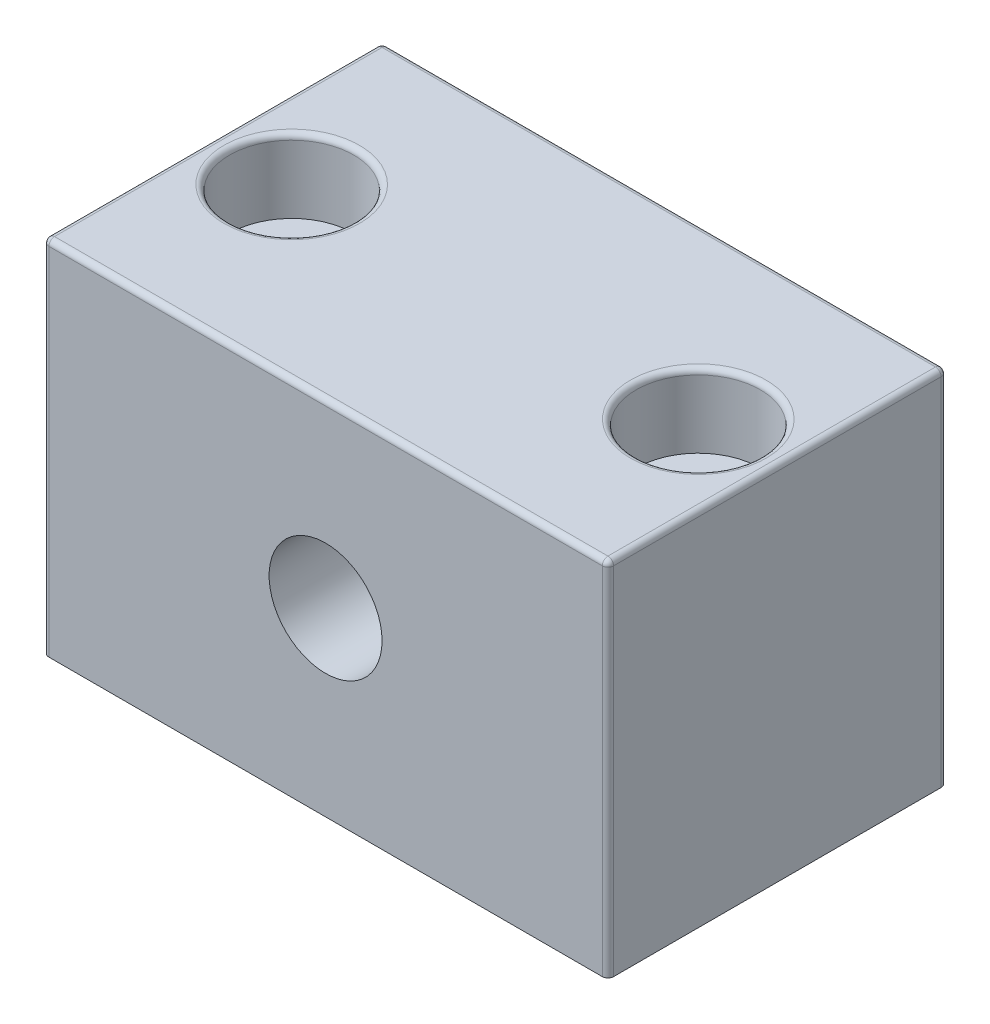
ISO-10303-21;
HEADER;
FILE_DESCRIPTION(('STEP AP214'),'2;1');
FILE_NAME('part.step','',(''),(''),'','','');
FILE_SCHEMA(('AUTOMOTIVE_DESIGN { 1 0 10303 214 1 1 1 1 }'));
ENDSEC;
DATA;
#1=APPLICATION_CONTEXT('core data for automotive mechanical design processes');
#2=APPLICATION_PROTOCOL_DEFINITION('international standard','automotive_design',2000,#1);
#3=PRODUCT_CONTEXT('',#1,'mechanical');
#4=PRODUCT('Part','Part','',(#3));
#5=PRODUCT_RELATED_PRODUCT_CATEGORY('part','',(#4));
#6=PRODUCT_DEFINITION_FORMATION('','',#4);
#7=PRODUCT_DEFINITION_CONTEXT('part definition',#1,'design');
#8=PRODUCT_DEFINITION('design','',#6,#7);
#9=PRODUCT_DEFINITION_SHAPE('','',#8);
#10=(LENGTH_UNIT() NAMED_UNIT(*) SI_UNIT(.MILLI.,.METRE.));
#11=(NAMED_UNIT(*) PLANE_ANGLE_UNIT() SI_UNIT($,.RADIAN.));
#12=(NAMED_UNIT(*) SI_UNIT($,.STERADIAN.) SOLID_ANGLE_UNIT());
#13=UNCERTAINTY_MEASURE_WITH_UNIT(LENGTH_MEASURE(1.E-05),#10,'distance_accuracy_value','');
#14=(GEOMETRIC_REPRESENTATION_CONTEXT(3) GLOBAL_UNCERTAINTY_ASSIGNED_CONTEXT((#13)) GLOBAL_UNIT_ASSIGNED_CONTEXT((#10,
#11,#12)) REPRESENTATION_CONTEXT('',''));
#15=CARTESIAN_POINT('',(0.,0.,0.));
#16=DIRECTION('',(0.,0.,1.));
#17=DIRECTION('',(1.,0.,0.));
#18=AXIS2_PLACEMENT_3D('',#15,#16,#17);
#19=CARTESIAN_POINT('',(0.,0.,-15.));
#20=DIRECTION('',(0.,-1.,0.));
#21=DIRECTION('',(0.,0.,-1.));
#22=AXIS2_PLACEMENT_3D('',#19,#20,#21);
#23=PLANE('',#22);
#24=DIRECTION('',(0.,0.,1.));
#25=VECTOR('',#24,1.);
#26=CARTESIAN_POINT('',(0.,0.,-15.));
#27=LINE('',#26,#25);
#28=CARTESIAN_POINT('',(0.,0.,-14.5));
#29=VERTEX_POINT('',#28);
#30=CARTESIAN_POINT('',(0.,0.,14.5));
#31=VERTEX_POINT('',#30);
#32=EDGE_CURVE('E244',#29,#31,#27,.T.);
#33=ORIENTED_EDGE('',*,*,#32,.F.);
#34=CARTESIAN_POINT('',(0.5,0.,-14.5));
#35=DIRECTION('',(0.,-1.,0.));
#36=DIRECTION('',(0.,0.,-1.));
#37=AXIS2_PLACEMENT_3D('',#34,#35,#36);
#38=CIRCLE('',#37,0.5);
#39=CARTESIAN_POINT('',(0.5,0.,-15.));
#40=VERTEX_POINT('',#39);
#41=EDGE_CURVE('E11',#29,#40,#38,.T.);
#42=ORIENTED_EDGE('',*,*,#41,.T.);
#43=DIRECTION('',(1.,0.,0.));
#44=VECTOR('',#43,1.);
#45=CARTESIAN_POINT('',(0.,0.,-15.));
#46=LINE('',#45,#44);
#47=CARTESIAN_POINT('',(49.5,0.,-15.));
#48=VERTEX_POINT('',#47);
#49=EDGE_CURVE('E241',#40,#48,#46,.T.);
#50=ORIENTED_EDGE('',*,*,#49,.T.);
#51=CARTESIAN_POINT('',(49.5,0.,-14.5));
#52=DIRECTION('',(0.,-1.,0.));
#53=DIRECTION('',(0.,0.,-1.));
#54=AXIS2_PLACEMENT_3D('',#51,#52,#53);
#55=CIRCLE('',#54,0.5);
#56=CARTESIAN_POINT('',(50.,0.,-14.5));
#57=VERTEX_POINT('',#56);
#58=EDGE_CURVE('E42',#48,#57,#55,.T.);
#59=ORIENTED_EDGE('',*,*,#58,.T.);
#60=DIRECTION('',(0.,0.,1.));
#61=VECTOR('',#60,1.);
#62=CARTESIAN_POINT('',(50.,0.,-15.));
#63=LINE('',#62,#61);
#64=CARTESIAN_POINT('',(50.,0.,14.5));
#65=VERTEX_POINT('',#64);
#66=EDGE_CURVE('E140',#57,#65,#63,.T.);
#67=ORIENTED_EDGE('',*,*,#66,.T.);
#68=CARTESIAN_POINT('',(49.5,0.,14.5));
#69=DIRECTION('',(0.,-1.,0.));
#70=DIRECTION('',(0.,0.,-1.));
#71=AXIS2_PLACEMENT_3D('',#68,#69,#70);
#72=CIRCLE('',#71,0.5);
#73=CARTESIAN_POINT('',(49.5,0.,15.));
#74=VERTEX_POINT('',#73);
#75=EDGE_CURVE('E185',#65,#74,#72,.T.);
#76=ORIENTED_EDGE('',*,*,#75,.T.);
#77=DIRECTION('',(1.,0.,0.));
#78=VECTOR('',#77,1.);
#79=CARTESIAN_POINT('',(0.,0.,15.));
#80=LINE('',#79,#78);
#81=CARTESIAN_POINT('',(0.5,0.,15.));
#82=VERTEX_POINT('',#81);
#83=EDGE_CURVE('E236',#82,#74,#80,.T.);
#84=ORIENTED_EDGE('',*,*,#83,.F.);
#85=CARTESIAN_POINT('',(0.5,0.,14.5));
#86=DIRECTION('',(0.,-1.,0.));
#87=DIRECTION('',(0.,0.,-1.));
#88=AXIS2_PLACEMENT_3D('',#85,#86,#87);
#89=CIRCLE('',#88,0.5);
#90=EDGE_CURVE('E183',#82,#31,#89,.T.);
#91=ORIENTED_EDGE('',*,*,#90,.T.);
#92=EDGE_LOOP('',(#33,#42,#50,#59,#67,#76,#84,#91));
#93=FACE_BOUND('',#92,.T.);
#94=CARTESIAN_POINT('',(43.,0.,0.));
#95=DIRECTION('',(0.,1.,0.));
#96=DIRECTION('',(0.,0.,1.));
#97=AXIS2_PLACEMENT_3D('',#94,#95,#96);
#98=CIRCLE('',#97,3.3);
#99=CARTESIAN_POINT('',(43.,0.,3.3));
#100=VERTEX_POINT('',#99);
#101=EDGE_CURVE('E224',#100,#100,#98,.T.);
#102=ORIENTED_EDGE('',*,*,#101,.T.);
#103=EDGE_LOOP('',(#102));
#104=FACE_BOUND('',#103,.T.);
#105=CARTESIAN_POINT('',(7.000000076,0.,0.));
#106=DIRECTION('',(0.,-1.,0.));
#107=DIRECTION('',(0.,0.,1.));
#108=AXIS2_PLACEMENT_3D('',#105,#106,#107);
#109=CIRCLE('',#108,3.3);
#110=CARTESIAN_POINT('',(7.000000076,0.,3.3));
#111=VERTEX_POINT('',#110);
#112=EDGE_CURVE('E213',#111,#111,#109,.T.);
#113=ORIENTED_EDGE('',*,*,#112,.F.);
#114=EDGE_LOOP('',(#113));
#115=FACE_BOUND('',#114,.T.);
#116=ADVANCED_FACE('F33',(#93,#104,#115),#23,.T.);
#117=CARTESIAN_POINT('',(7.000000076,25.5,0.));
#118=DIRECTION('',(0.,1.,0.));
#119=DIRECTION('',(0.,0.,1.));
#120=AXIS2_PLACEMENT_3D('',#117,#118,#119);
#121=PLANE('',#120);
#122=CARTESIAN_POINT('',(7.000000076,25.5,0.));
#123=DIRECTION('',(0.,-1.,0.));
#124=DIRECTION('',(0.,0.,1.));
#125=AXIS2_PLACEMENT_3D('',#122,#123,#124);
#126=CIRCLE('',#125,5.5);
#127=CARTESIAN_POINT('',(7.000000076,25.5,5.5));
#128=VERTEX_POINT('',#127);
#129=EDGE_CURVE('E218',#128,#128,#126,.T.);
#130=ORIENTED_EDGE('',*,*,#129,.F.);
#131=EDGE_LOOP('',(#130));
#132=FACE_BOUND('',#131,.T.);
#133=CARTESIAN_POINT('',(7.000000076,25.5,0.));
#134=DIRECTION('',(0.,-1.,0.));
#135=DIRECTION('',(0.,0.,1.));
#136=AXIS2_PLACEMENT_3D('',#133,#134,#135);
#137=CIRCLE('',#136,3.3);
#138=CARTESIAN_POINT('',(7.000000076,25.5,3.3));
#139=VERTEX_POINT('',#138);
#140=EDGE_CURVE('E210',#139,#139,#137,.T.);
#141=ORIENTED_EDGE('',*,*,#140,.T.);
#142=EDGE_LOOP('',(#141));
#143=FACE_BOUND('',#142,.T.);
#144=ADVANCED_FACE('F291',(#132,#143),#121,.T.);
#145=CARTESIAN_POINT('',(0.,32.,-15.));
#146=DIRECTION('',(0.,1.,0.));
#147=DIRECTION('',(0.,0.,1.));
#148=AXIS2_PLACEMENT_3D('',#145,#146,#147);
#149=PLANE('',#148);
#150=CARTESIAN_POINT('',(7.000000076,32.,0.));
#151=DIRECTION('',(0.,1.,0.));
#152=DIRECTION('',(0.,0.,1.));
#153=AXIS2_PLACEMENT_3D('',#150,#151,#152);
#154=CIRCLE('',#153,6.);
#155=CARTESIAN_POINT('',(7.000000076,32.,6.));
#156=VERTEX_POINT('',#155);
#157=EDGE_CURVE('E149',#156,#156,#154,.F.);
#158=ORIENTED_EDGE('',*,*,#157,.T.);
#159=EDGE_LOOP('',(#158));
#160=FACE_BOUND('',#159,.T.);
#161=CARTESIAN_POINT('',(43.,32.,0.));
#162=DIRECTION('',(0.,1.,0.));
#163=DIRECTION('',(0.,0.,1.));
#164=AXIS2_PLACEMENT_3D('',#161,#162,#163);
#165=CIRCLE('',#164,6.);
#166=CARTESIAN_POINT('',(43.,32.,6.));
#167=VERTEX_POINT('',#166);
#168=EDGE_CURVE('E146',#167,#167,#165,.F.);
#169=ORIENTED_EDGE('',*,*,#168,.T.);
#170=EDGE_LOOP('',(#169));
#171=FACE_BOUND('',#170,.T.);
#172=DIRECTION('',(0.,0.,1.));
#173=VECTOR('',#172,1.);
#174=CARTESIAN_POINT('',(49.5,32.,-15.));
#175=LINE('',#174,#173);
#176=CARTESIAN_POINT('',(49.5,32.,14.5));
#177=VERTEX_POINT('',#176);
#178=CARTESIAN_POINT('',(49.5,32.,-14.5));
#179=VERTEX_POINT('',#178);
#180=EDGE_CURVE('E144',#177,#179,#175,.F.);
#181=ORIENTED_EDGE('',*,*,#180,.T.);
#182=DIRECTION('',(-1.,0.,0.));
#183=VECTOR('',#182,1.);
#184=CARTESIAN_POINT('',(0.,32.,-14.5));
#185=LINE('',#184,#183);
#186=CARTESIAN_POINT('',(0.5,32.,-14.5));
#187=VERTEX_POINT('',#186);
#188=EDGE_CURVE('E116',#179,#187,#185,.T.);
#189=ORIENTED_EDGE('',*,*,#188,.T.);
#190=DIRECTION('',(0.,0.,1.));
#191=VECTOR('',#190,1.);
#192=CARTESIAN_POINT('',(0.5,32.,-15.));
#193=LINE('',#192,#191);
#194=CARTESIAN_POINT('',(0.5,32.,14.5));
#195=VERTEX_POINT('',#194);
#196=EDGE_CURVE('E133',#187,#195,#193,.T.);
#197=ORIENTED_EDGE('',*,*,#196,.T.);
#198=DIRECTION('',(-1.,0.,0.));
#199=VECTOR('',#198,1.);
#200=CARTESIAN_POINT('',(50.,32.,14.5));
#201=LINE('',#200,#199);
#202=EDGE_CURVE('E139',#195,#177,#201,.F.);
#203=ORIENTED_EDGE('',*,*,#202,.T.);
#204=EDGE_LOOP('',(#181,#189,#197,#203));
#205=FACE_BOUND('',#204,.T.);
#206=ADVANCED_FACE('F142',(#160,#171,#205),#149,.T.);
#207=CARTESIAN_POINT('',(0.,0.,-15.));
#208=DIRECTION('',(-1.,0.,0.));
#209=DIRECTION('',(0.,0.,1.));
#210=AXIS2_PLACEMENT_3D('',#207,#208,#209);
#211=PLANE('',#210);
#212=DIRECTION('',(0.,0.,1.));
#213=VECTOR('',#212,1.);
#214=CARTESIAN_POINT('',(0.,31.5,-15.));
#215=LINE('',#214,#213);
#216=CARTESIAN_POINT('',(0.,31.5,14.5));
#217=VERTEX_POINT('',#216);
#218=CARTESIAN_POINT('',(0.,31.5,-14.5));
#219=VERTEX_POINT('',#218);
#220=EDGE_CURVE('E50',#217,#219,#215,.F.);
#221=ORIENTED_EDGE('',*,*,#220,.T.);
#222=DIRECTION('',(0.,-1.,0.));
#223=VECTOR('',#222,1.);
#224=CARTESIAN_POINT('',(0.,0.,-14.5));
#225=LINE('',#224,#223);
#226=EDGE_CURVE('E181',#219,#29,#225,.T.);
#227=ORIENTED_EDGE('',*,*,#226,.T.);
#228=ORIENTED_EDGE('',*,*,#32,.T.);
#229=DIRECTION('',(0.,-1.,0.));
#230=VECTOR('',#229,1.);
#231=CARTESIAN_POINT('',(0.,32.,14.5));
#232=LINE('',#231,#230);
#233=EDGE_CURVE('E55',#31,#217,#232,.F.);
#234=ORIENTED_EDGE('',*,*,#233,.T.);
#235=EDGE_LOOP('',(#221,#227,#228,#234));
#236=FACE_BOUND('',#235,.T.);
#237=ADVANCED_FACE('F272',(#236),#211,.T.);
#238=CARTESIAN_POINT('',(50.,0.,-15.));
#239=DIRECTION('',(1.,0.,0.));
#240=DIRECTION('',(0.,0.,-1.));
#241=AXIS2_PLACEMENT_3D('',#238,#239,#240);
#242=PLANE('',#241);
#243=ORIENTED_EDGE('',*,*,#66,.F.);
#244=DIRECTION('',(0.,1.,0.));
#245=VECTOR('',#244,1.);
#246=CARTESIAN_POINT('',(50.,0.,-14.5));
#247=LINE('',#246,#245);
#248=CARTESIAN_POINT('',(50.,31.5,-14.5));
#249=VERTEX_POINT('',#248);
#250=EDGE_CURVE('E171',#57,#249,#247,.T.);
#251=ORIENTED_EDGE('',*,*,#250,.T.);
#252=DIRECTION('',(0.,0.,1.));
#253=VECTOR('',#252,1.);
#254=CARTESIAN_POINT('',(50.,31.5,-15.));
#255=LINE('',#254,#253);
#256=CARTESIAN_POINT('',(50.,31.5,14.5));
#257=VERTEX_POINT('',#256);
#258=EDGE_CURVE('E169',#249,#257,#255,.T.);
#259=ORIENTED_EDGE('',*,*,#258,.T.);
#260=DIRECTION('',(0.,1.,0.));
#261=VECTOR('',#260,1.);
#262=CARTESIAN_POINT('',(50.,0.,14.5));
#263=LINE('',#262,#261);
#264=EDGE_CURVE('E167',#257,#65,#263,.F.);
#265=ORIENTED_EDGE('',*,*,#264,.T.);
#266=EDGE_LOOP('',(#243,#251,#259,#265));
#267=FACE_BOUND('',#266,.T.);
#268=ADVANCED_FACE('F300',(#267),#242,.T.);
#269=CARTESIAN_POINT('',(0.,0.,-15.));
#270=DIRECTION('',(0.,0.,-1.));
#271=DIRECTION('',(-1.,0.,0.));
#272=AXIS2_PLACEMENT_3D('',#269,#270,#271);
#273=PLANE('',#272);
#274=CARTESIAN_POINT('',(25.,16.,-15.));
#275=DIRECTION('',(0.,0.,1.));
#276=DIRECTION('',(1.,0.,0.));
#277=AXIS2_PLACEMENT_3D('',#274,#275,#276);
#278=CIRCLE('',#277,5.);
#279=CARTESIAN_POINT('',(30.,16.,-15.));
#280=VERTEX_POINT('',#279);
#281=EDGE_CURVE('E233',#280,#280,#278,.T.);
#282=ORIENTED_EDGE('',*,*,#281,.T.);
#283=EDGE_LOOP('',(#282));
#284=FACE_BOUND('',#283,.T.);
#285=ORIENTED_EDGE('',*,*,#49,.F.);
#286=DIRECTION('',(0.,-1.,0.));
#287=VECTOR('',#286,1.);
#288=CARTESIAN_POINT('',(0.5,0.,-15.));
#289=LINE('',#288,#287);
#290=CARTESIAN_POINT('',(0.5,31.5,-15.));
#291=VERTEX_POINT('',#290);
#292=EDGE_CURVE('E165',#40,#291,#289,.F.);
#293=ORIENTED_EDGE('',*,*,#292,.T.);
#294=DIRECTION('',(-1.,0.,0.));
#295=VECTOR('',#294,1.);
#296=CARTESIAN_POINT('',(0.,31.5,-15.));
#297=LINE('',#296,#295);
#298=CARTESIAN_POINT('',(49.5,31.5,-15.));
#299=VERTEX_POINT('',#298);
#300=EDGE_CURVE('E118',#291,#299,#297,.F.);
#301=ORIENTED_EDGE('',*,*,#300,.T.);
#302=DIRECTION('',(0.,1.,0.));
#303=VECTOR('',#302,1.);
#304=CARTESIAN_POINT('',(49.5,0.,-15.));
#305=LINE('',#304,#303);
#306=EDGE_CURVE('E162',#299,#48,#305,.F.);
#307=ORIENTED_EDGE('',*,*,#306,.T.);
#308=EDGE_LOOP('',(#285,#293,#301,#307));
#309=FACE_BOUND('',#308,.T.);
#310=ADVANCED_FACE('F266',(#284,#309),#273,.T.);
#311=CARTESIAN_POINT('',(0.,0.,15.));
#312=DIRECTION('',(0.,0.,-1.));
#313=DIRECTION('',(-1.,0.,0.));
#314=AXIS2_PLACEMENT_3D('',#311,#312,#313);
#315=PLANE('',#314);
#316=CARTESIAN_POINT('',(25.,16.,15.));
#317=DIRECTION('',(0.,0.,1.));
#318=DIRECTION('',(1.,0.,0.));
#319=AXIS2_PLACEMENT_3D('',#316,#317,#318);
#320=CIRCLE('',#319,5.);
#321=CARTESIAN_POINT('',(30.,16.,15.));
#322=VERTEX_POINT('',#321);
#323=EDGE_CURVE('E232',#322,#322,#320,.T.);
#324=ORIENTED_EDGE('',*,*,#323,.F.);
#325=EDGE_LOOP('',(#324));
#326=FACE_BOUND('',#325,.T.);
#327=ORIENTED_EDGE('',*,*,#83,.T.);
#328=DIRECTION('',(0.,1.,0.));
#329=VECTOR('',#328,1.);
#330=CARTESIAN_POINT('',(49.5,32.,15.));
#331=LINE('',#330,#329);
#332=CARTESIAN_POINT('',(49.5,31.5,15.));
#333=VERTEX_POINT('',#332);
#334=EDGE_CURVE('E177',#74,#333,#331,.T.);
#335=ORIENTED_EDGE('',*,*,#334,.T.);
#336=DIRECTION('',(-1.,0.,0.));
#337=VECTOR('',#336,1.);
#338=CARTESIAN_POINT('',(0.,31.5,15.));
#339=LINE('',#338,#337);
#340=CARTESIAN_POINT('',(0.5,31.5,15.));
#341=VERTEX_POINT('',#340);
#342=EDGE_CURVE('E175',#333,#341,#339,.T.);
#343=ORIENTED_EDGE('',*,*,#342,.T.);
#344=DIRECTION('',(0.,-1.,0.));
#345=VECTOR('',#344,1.);
#346=CARTESIAN_POINT('',(0.5,0.,15.));
#347=LINE('',#346,#345);
#348=EDGE_CURVE('E173',#341,#82,#347,.T.);
#349=ORIENTED_EDGE('',*,*,#348,.T.);
#350=EDGE_LOOP('',(#327,#335,#343,#349));
#351=FACE_BOUND('',#350,.T.);
#352=ADVANCED_FACE('F474',(#326,#351),#315,.F.);
#353=CARTESIAN_POINT('',(25.,16.,-15.));
#354=DIRECTION('',(0.,0.,1.));
#355=DIRECTION('',(1.,0.,0.));
#356=AXIS2_PLACEMENT_3D('',#353,#354,#355);
#357=CYLINDRICAL_SURFACE('',#356,5.);
#358=ORIENTED_EDGE('',*,*,#281,.F.);
#359=EDGE_LOOP('',(#358));
#360=FACE_BOUND('',#359,.T.);
#361=ORIENTED_EDGE('',*,*,#323,.T.);
#362=EDGE_LOOP('',(#361));
#363=FACE_BOUND('',#362,.T.);
#364=ADVANCED_FACE('F465',(#360,#363),#357,.F.);
#365=CARTESIAN_POINT('',(43.,25.5,0.));
#366=DIRECTION('',(0.,1.,0.));
#367=DIRECTION('',(0.,0.,1.));
#368=AXIS2_PLACEMENT_3D('',#365,#366,#367);
#369=CYLINDRICAL_SURFACE('',#368,5.5);
#370=CARTESIAN_POINT('',(43.,31.5,0.));
#371=DIRECTION('',(0.,1.,0.));
#372=DIRECTION('',(0.,0.,1.));
#373=AXIS2_PLACEMENT_3D('',#370,#371,#372);
#374=CIRCLE('',#373,5.5);
#375=CARTESIAN_POINT('',(43.,31.5,5.5));
#376=VERTEX_POINT('',#375);
#377=EDGE_CURVE('E159',#376,#376,#374,.T.);
#378=CARTESIAN_POINT('',(43.,25.5,0.));
#379=DIRECTION('',(0.,1.,0.));
#380=DIRECTION('',(0.,0.,1.));
#381=AXIS2_PLACEMENT_3D('',#378,#379,#380);
#382=CIRCLE('',#381,5.5);
#383=CARTESIAN_POINT('',(43.,25.5,5.5));
#384=VERTEX_POINT('',#383);
#385=EDGE_CURVE('E227',#384,#384,#382,.T.);
#386=CARTESIAN_POINT('',(43.,31.5,5.5));
#387=CARTESIAN_POINT('',(43.,31.4375,5.5));
#388=CARTESIAN_POINT('',(43.,31.375,5.5));
#389=CARTESIAN_POINT('',(43.,31.25,5.5));
#390=CARTESIAN_POINT('',(43.,31.1875,5.5));
#391=CARTESIAN_POINT('',(43.,31.0625,5.5));
#392=CARTESIAN_POINT('',(43.,31.,5.5));
#393=CARTESIAN_POINT('',(43.,30.875,5.5));
#394=CARTESIAN_POINT('',(43.,30.8125,5.5));
#395=CARTESIAN_POINT('',(43.,30.6875,5.5));
#396=CARTESIAN_POINT('',(43.,30.625,5.5));
#397=CARTESIAN_POINT('',(43.,30.5,5.5));
#398=CARTESIAN_POINT('',(43.,30.4375,5.5));
#399=CARTESIAN_POINT('',(43.,30.3125,5.5));
#400=CARTESIAN_POINT('',(43.,30.25,5.5));
#401=CARTESIAN_POINT('',(43.,30.125,5.5));
#402=CARTESIAN_POINT('',(43.,30.0625,5.5));
#403=CARTESIAN_POINT('',(43.,29.9375,5.5));
#404=CARTESIAN_POINT('',(43.,29.875,5.5));
#405=CARTESIAN_POINT('',(43.,29.75,5.5));
#406=CARTESIAN_POINT('',(43.,29.6875,5.5));
#407=CARTESIAN_POINT('',(43.,29.5625,5.5));
#408=CARTESIAN_POINT('',(43.,29.5,5.5));
#409=CARTESIAN_POINT('',(43.,29.375,5.5));
#410=CARTESIAN_POINT('',(43.,29.3125,5.5));
#411=CARTESIAN_POINT('',(43.,29.1875,5.5));
#412=CARTESIAN_POINT('',(43.,29.125,5.5));
#413=CARTESIAN_POINT('',(43.,29.,5.5));
#414=CARTESIAN_POINT('',(43.,28.9375,5.5));
#415=CARTESIAN_POINT('',(43.,28.8125,5.5));
#416=CARTESIAN_POINT('',(43.,28.75,5.5));
#417=CARTESIAN_POINT('',(43.,28.625,5.5));
#418=CARTESIAN_POINT('',(43.,28.5625,5.5));
#419=CARTESIAN_POINT('',(43.,28.4375,5.5));
#420=CARTESIAN_POINT('',(43.,28.375,5.5));
#421=CARTESIAN_POINT('',(43.,28.25,5.5));
#422=CARTESIAN_POINT('',(43.,28.1875,5.5));
#423=CARTESIAN_POINT('',(43.,28.0625,5.5));
#424=CARTESIAN_POINT('',(43.,28.,5.5));
#425=CARTESIAN_POINT('',(43.,27.875,5.5));
#426=CARTESIAN_POINT('',(43.,27.8125,5.5));
#427=CARTESIAN_POINT('',(43.,27.6875,5.5));
#428=CARTESIAN_POINT('',(43.,27.625,5.5));
#429=CARTESIAN_POINT('',(43.,27.5,5.5));
#430=CARTESIAN_POINT('',(43.,27.4375,5.5));
#431=CARTESIAN_POINT('',(43.,27.3125,5.5));
#432=CARTESIAN_POINT('',(43.,27.25,5.5));
#433=CARTESIAN_POINT('',(43.,27.125,5.5));
#434=CARTESIAN_POINT('',(43.,27.0625,5.5));
#435=CARTESIAN_POINT('',(43.,26.9375,5.5));
#436=CARTESIAN_POINT('',(43.,26.875,5.5));
#437=CARTESIAN_POINT('',(43.,26.75,5.5));
#438=CARTESIAN_POINT('',(43.,26.6875,5.5));
#439=CARTESIAN_POINT('',(43.,26.5625,5.5));
#440=CARTESIAN_POINT('',(43.,26.5,5.5));
#441=CARTESIAN_POINT('',(43.,26.375,5.5));
#442=CARTESIAN_POINT('',(43.,26.3125,5.5));
#443=CARTESIAN_POINT('',(43.,26.1875,5.5));
#444=CARTESIAN_POINT('',(43.,26.125,5.5));
#445=CARTESIAN_POINT('',(43.,26.,5.5));
#446=CARTESIAN_POINT('',(43.,25.9375,5.5));
#447=CARTESIAN_POINT('',(43.,25.8125,5.5));
#448=CARTESIAN_POINT('',(43.,25.75,5.5));
#449=CARTESIAN_POINT('',(43.,25.625,5.5));
#450=CARTESIAN_POINT('',(43.,25.5625,5.5));
#451=CARTESIAN_POINT('',(43.,25.5,5.5));
#452=B_SPLINE_CURVE_WITH_KNOTS('',3,(#386,#387,#388,#389,#390,#391,#392,#393,#394,#395,#396,
#397,#398,#399,#400,#401,#402,#403,#404,#405,#406,#407,#408,#409,#410,#411,#412,#413,#414,#415,
#416,#417,#418,#419,#420,#421,#422,#423,#424,#425,#426,#427,#428,#429,#430,#431,#432,#433,#434,
#435,#436,#437,#438,#439,#440,#441,#442,#443,#444,#445,#446,#447,#448,#449,#450,#451),
.UNSPECIFIED.,.F.,.F.,(4,2,2,2,2,2,2,2,2,2,2,2,2,2,2,2,2,2,2,2,2,2,2,2,2,2,2,2,2,2,2,2,4),(0.,
0.1875,0.374999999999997,0.562499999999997,0.749999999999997,0.937499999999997,1.125,1.3125,1.5,
1.68749999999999,1.87499999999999,2.06249999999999,2.25,2.4375,2.625,2.8125,3.,3.1875,3.375,
3.5625,3.75,3.93749999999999,4.12499999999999,4.31249999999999,4.49999999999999,
4.68749999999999,4.87499999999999,5.06249999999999,5.24999999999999,5.43749999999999,
5.62499999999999,5.81249999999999,5.99999999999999),.UNSPECIFIED.);
#453=EDGE_CURVE('BSEAM456',#376,#384,#452,.T.);
#454=ORIENTED_EDGE('',*,*,#377,.T.);
#455=ORIENTED_EDGE('',*,*,#385,.F.);
#456=ORIENTED_EDGE('',*,*,#453,.T.);
#457=ORIENTED_EDGE('',*,*,#453,.F.);
#458=EDGE_LOOP('',(#454,#456,#455,#457));
#459=FACE_BOUND('',#458,.T.);
#460=ADVANCED_FACE('F456',(#459),#369,.F.);
#461=CARTESIAN_POINT('',(43.,25.5,0.));
#462=DIRECTION('',(0.,1.,0.));
#463=DIRECTION('',(0.,0.,1.));
#464=AXIS2_PLACEMENT_3D('',#461,#462,#463);
#465=PLANE('',#464);
#466=CARTESIAN_POINT('',(43.,25.5,0.));
#467=DIRECTION('',(0.,1.,0.));
#468=DIRECTION('',(0.,0.,1.));
#469=AXIS2_PLACEMENT_3D('',#466,#467,#468);
#470=CIRCLE('',#469,3.3);
#471=CARTESIAN_POINT('',(43.,25.5,3.3));
#472=VERTEX_POINT('',#471);
#473=EDGE_CURVE('E223',#472,#472,#470,.T.);
#474=ORIENTED_EDGE('',*,*,#473,.F.);
#475=EDGE_LOOP('',(#474));
#476=FACE_BOUND('',#475,.T.);
#477=ORIENTED_EDGE('',*,*,#385,.T.);
#478=EDGE_LOOP('',(#477));
#479=FACE_BOUND('',#478,.T.);
#480=ADVANCED_FACE('F447',(#476,#479),#465,.T.);
#481=CARTESIAN_POINT('',(43.,0.,0.));
#482=DIRECTION('',(0.,1.,0.));
#483=DIRECTION('',(0.,0.,1.));
#484=AXIS2_PLACEMENT_3D('',#481,#482,#483);
#485=CYLINDRICAL_SURFACE('',#484,3.3);
#486=ORIENTED_EDGE('',*,*,#101,.F.);
#487=EDGE_LOOP('',(#486));
#488=FACE_BOUND('',#487,.T.);
#489=ORIENTED_EDGE('',*,*,#473,.T.);
#490=EDGE_LOOP('',(#489));
#491=FACE_BOUND('',#490,.T.);
#492=ADVANCED_FACE('F431',(#488,#491),#485,.F.);
#493=CARTESIAN_POINT('',(7.000000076,25.5,0.));
#494=DIRECTION('',(0.,1.,0.));
#495=DIRECTION('',(0.,0.,1.));
#496=AXIS2_PLACEMENT_3D('',#493,#494,#495);
#497=CYLINDRICAL_SURFACE('',#496,5.5);
#498=CARTESIAN_POINT('',(7.000000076,31.5,0.));
#499=DIRECTION('',(0.,1.,0.));
#500=DIRECTION('',(0.,0.,1.));
#501=AXIS2_PLACEMENT_3D('',#498,#499,#500);
#502=CIRCLE('',#501,5.5);
#503=CARTESIAN_POINT('',(7.000000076,31.5,5.5));
#504=VERTEX_POINT('',#503);
#505=EDGE_CURVE('E156',#504,#504,#502,.T.);
#506=CARTESIAN_POINT('',(7.000000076,31.5,5.5));
#507=CARTESIAN_POINT('',(7.000000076,31.4375,5.5));
#508=CARTESIAN_POINT('',(7.000000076,31.375,5.5));
#509=CARTESIAN_POINT('',(7.000000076,31.25,5.5));
#510=CARTESIAN_POINT('',(7.000000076,31.1875,5.5));
#511=CARTESIAN_POINT('',(7.000000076,31.0625,5.5));
#512=CARTESIAN_POINT('',(7.000000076,31.,5.5));
#513=CARTESIAN_POINT('',(7.000000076,30.875,5.5));
#514=CARTESIAN_POINT('',(7.000000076,30.8125,5.5));
#515=CARTESIAN_POINT('',(7.000000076,30.6875,5.5));
#516=CARTESIAN_POINT('',(7.000000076,30.625,5.5));
#517=CARTESIAN_POINT('',(7.000000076,30.5,5.5));
#518=CARTESIAN_POINT('',(7.000000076,30.4375,5.5));
#519=CARTESIAN_POINT('',(7.000000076,30.3125,5.5));
#520=CARTESIAN_POINT('',(7.000000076,30.25,5.5));
#521=CARTESIAN_POINT('',(7.000000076,30.125,5.5));
#522=CARTESIAN_POINT('',(7.000000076,30.0625,5.5));
#523=CARTESIAN_POINT('',(7.000000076,29.9375,5.5));
#524=CARTESIAN_POINT('',(7.000000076,29.875,5.5));
#525=CARTESIAN_POINT('',(7.000000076,29.75,5.5));
#526=CARTESIAN_POINT('',(7.000000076,29.6875,5.5));
#527=CARTESIAN_POINT('',(7.000000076,29.5625,5.5));
#528=CARTESIAN_POINT('',(7.000000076,29.5,5.5));
#529=CARTESIAN_POINT('',(7.000000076,29.375,5.5));
#530=CARTESIAN_POINT('',(7.000000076,29.3125,5.5));
#531=CARTESIAN_POINT('',(7.000000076,29.1875,5.5));
#532=CARTESIAN_POINT('',(7.000000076,29.125,5.5));
#533=CARTESIAN_POINT('',(7.000000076,29.,5.5));
#534=CARTESIAN_POINT('',(7.000000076,28.9375,5.5));
#535=CARTESIAN_POINT('',(7.000000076,28.8125,5.5));
#536=CARTESIAN_POINT('',(7.000000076,28.75,5.5));
#537=CARTESIAN_POINT('',(7.000000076,28.625,5.5));
#538=CARTESIAN_POINT('',(7.000000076,28.5625,5.5));
#539=CARTESIAN_POINT('',(7.000000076,28.4375,5.5));
#540=CARTESIAN_POINT('',(7.000000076,28.375,5.5));
#541=CARTESIAN_POINT('',(7.000000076,28.25,5.5));
#542=CARTESIAN_POINT('',(7.000000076,28.1875,5.5));
#543=CARTESIAN_POINT('',(7.000000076,28.0625,5.5));
#544=CARTESIAN_POINT('',(7.000000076,28.,5.5));
#545=CARTESIAN_POINT('',(7.000000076,27.875,5.5));
#546=CARTESIAN_POINT('',(7.000000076,27.8125,5.5));
#547=CARTESIAN_POINT('',(7.000000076,27.6875,5.5));
#548=CARTESIAN_POINT('',(7.000000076,27.625,5.5));
#549=CARTESIAN_POINT('',(7.000000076,27.5,5.5));
#550=CARTESIAN_POINT('',(7.000000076,27.4375,5.5));
#551=CARTESIAN_POINT('',(7.000000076,27.3125,5.5));
#552=CARTESIAN_POINT('',(7.000000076,27.25,5.5));
#553=CARTESIAN_POINT('',(7.000000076,27.125,5.5));
#554=CARTESIAN_POINT('',(7.000000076,27.0625,5.5));
#555=CARTESIAN_POINT('',(7.000000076,26.9375,5.5));
#556=CARTESIAN_POINT('',(7.000000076,26.875,5.5));
#557=CARTESIAN_POINT('',(7.000000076,26.75,5.5));
#558=CARTESIAN_POINT('',(7.000000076,26.6875,5.5));
#559=CARTESIAN_POINT('',(7.000000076,26.5625,5.5));
#560=CARTESIAN_POINT('',(7.000000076,26.5,5.5));
#561=CARTESIAN_POINT('',(7.000000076,26.375,5.5));
#562=CARTESIAN_POINT('',(7.000000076,26.3125,5.5));
#563=CARTESIAN_POINT('',(7.000000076,26.1875,5.5));
#564=CARTESIAN_POINT('',(7.000000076,26.125,5.5));
#565=CARTESIAN_POINT('',(7.000000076,26.,5.5));
#566=CARTESIAN_POINT('',(7.000000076,25.9375,5.5));
#567=CARTESIAN_POINT('',(7.000000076,25.8125,5.5));
#568=CARTESIAN_POINT('',(7.000000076,25.75,5.5));
#569=CARTESIAN_POINT('',(7.000000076,25.625,5.5));
#570=CARTESIAN_POINT('',(7.000000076,25.5625,5.5));
#571=CARTESIAN_POINT('',(7.000000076,25.5,5.5));
#572=B_SPLINE_CURVE_WITH_KNOTS('',3,(#506,#507,#508,#509,#510,#511,#512,#513,#514,#515,#516,
#517,#518,#519,#520,#521,#522,#523,#524,#525,#526,#527,#528,#529,#530,#531,#532,#533,#534,#535,
#536,#537,#538,#539,#540,#541,#542,#543,#544,#545,#546,#547,#548,#549,#550,#551,#552,#553,#554,
#555,#556,#557,#558,#559,#560,#561,#562,#563,#564,#565,#566,#567,#568,#569,#570,#571),
.UNSPECIFIED.,.F.,.F.,(4,2,2,2,2,2,2,2,2,2,2,2,2,2,2,2,2,2,2,2,2,2,2,2,2,2,2,2,2,2,2,2,4),(0.,
0.1875,0.374999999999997,0.562499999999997,0.749999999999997,0.937499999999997,1.125,
1.31249999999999,1.49999999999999,1.68749999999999,1.87499999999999,2.06249999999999,2.25,
2.4375,2.625,2.8125,2.99999999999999,3.18749999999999,3.37499999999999,3.56249999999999,
3.74999999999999,3.93749999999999,4.12499999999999,4.31249999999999,4.49999999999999,
4.68749999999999,4.87499999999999,5.06249999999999,5.24999999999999,5.43749999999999,
5.62499999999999,5.81249999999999,5.99999999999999),.UNSPECIFIED.);
#573=EDGE_CURVE('BSEAM412',#504,#128,#572,.T.);
#574=ORIENTED_EDGE('',*,*,#505,.T.);
#575=ORIENTED_EDGE('',*,*,#129,.T.);
#576=ORIENTED_EDGE('',*,*,#573,.T.);
#577=ORIENTED_EDGE('',*,*,#573,.F.);
#578=EDGE_LOOP('',(#574,#576,#575,#577));
#579=FACE_BOUND('',#578,.T.);
#580=ADVANCED_FACE('F412',(#579),#497,.F.);
#581=CARTESIAN_POINT('',(7.000000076,0.,0.));
#582=DIRECTION('',(0.,1.,0.));
#583=DIRECTION('',(0.,0.,1.));
#584=AXIS2_PLACEMENT_3D('',#581,#582,#583);
#585=CYLINDRICAL_SURFACE('',#584,3.3);
#586=ORIENTED_EDGE('',*,*,#112,.T.);
#587=EDGE_LOOP('',(#586));
#588=FACE_BOUND('',#587,.T.);
#589=ORIENTED_EDGE('',*,*,#140,.F.);
#590=EDGE_LOOP('',(#589));
#591=FACE_BOUND('',#590,.T.);
#592=ADVANCED_FACE('F308',(#588,#591),#585,.F.);
#593=CARTESIAN_POINT('',(7.000000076,31.5,0.));
#594=DIRECTION('',(0.,1.,0.));
#595=DIRECTION('',(0.,0.,1.));
#596=AXIS2_PLACEMENT_3D('',#593,#594,#595);
#597=TOROIDAL_SURFACE('',#596,6.,0.5);
#598=ORIENTED_EDGE('',*,*,#505,.F.);
#599=EDGE_LOOP('',(#598));
#600=FACE_BOUND('',#599,.T.);
#601=ORIENTED_EDGE('',*,*,#157,.F.);
#602=EDGE_LOOP('',(#601));
#603=FACE_BOUND('',#602,.T.);
#604=ADVANCED_FACE('F304',(#600,#603),#597,.T.);
#605=CARTESIAN_POINT('',(43.,31.5,0.));
#606=DIRECTION('',(0.,1.,0.));
#607=DIRECTION('',(0.,0.,1.));
#608=AXIS2_PLACEMENT_3D('',#605,#606,#607);
#609=TOROIDAL_SURFACE('',#608,6.,0.5);
#610=ORIENTED_EDGE('',*,*,#168,.F.);
#611=EDGE_LOOP('',(#610));
#612=FACE_BOUND('',#611,.T.);
#613=ORIENTED_EDGE('',*,*,#377,.F.);
#614=EDGE_LOOP('',(#613));
#615=FACE_BOUND('',#614,.T.);
#616=ADVANCED_FACE('F307',(#612,#615),#609,.T.);
#617=CARTESIAN_POINT('',(49.5,0.,14.5));
#618=DIRECTION('',(0.,-1.,0.));
#619=DIRECTION('',(0.,0.,-1.));
#620=AXIS2_PLACEMENT_3D('',#617,#618,#619);
#621=CYLINDRICAL_SURFACE('',#620,0.5);
#622=ORIENTED_EDGE('',*,*,#75,.F.);
#623=ORIENTED_EDGE('',*,*,#264,.F.);
#624=CARTESIAN_POINT('',(49.5,31.5,14.5));
#625=DIRECTION('',(0.,1.,0.));
#626=DIRECTION('',(0.,0.,1.));
#627=AXIS2_PLACEMENT_3D('',#624,#625,#626);
#628=CIRCLE('',#627,0.5);
#629=EDGE_CURVE('E37',#333,#257,#628,.T.);
#630=ORIENTED_EDGE('',*,*,#629,.F.);
#631=ORIENTED_EDGE('',*,*,#334,.F.);
#632=EDGE_LOOP('',(#622,#623,#630,#631));
#633=FACE_BOUND('',#632,.T.);
#634=ADVANCED_FACE('F35',(#633),#621,.T.);
#635=CARTESIAN_POINT('',(0.,31.5,14.5));
#636=DIRECTION('',(1.,0.,0.));
#637=DIRECTION('',(0.,0.,-1.));
#638=AXIS2_PLACEMENT_3D('',#635,#636,#637);
#639=CYLINDRICAL_SURFACE('',#638,0.5);
#640=CARTESIAN_POINT('',(0.5,31.5,14.5));
#641=DIRECTION('',(-1.,0.,0.));
#642=DIRECTION('',(0.,0.,1.));
#643=AXIS2_PLACEMENT_3D('',#640,#641,#642);
#644=CIRCLE('',#643,0.5);
#645=EDGE_CURVE('E202',#341,#195,#644,.T.);
#646=ORIENTED_EDGE('',*,*,#645,.F.);
#647=ORIENTED_EDGE('',*,*,#342,.F.);
#648=CARTESIAN_POINT('',(49.5,31.5,14.5));
#649=DIRECTION('',(1.,0.,0.));
#650=DIRECTION('',(0.,0.,-1.));
#651=AXIS2_PLACEMENT_3D('',#648,#649,#650);
#652=CIRCLE('',#651,0.5);
#653=EDGE_CURVE('E204',#177,#333,#652,.T.);
#654=ORIENTED_EDGE('',*,*,#653,.F.);
#655=ORIENTED_EDGE('',*,*,#202,.F.);
#656=EDGE_LOOP('',(#646,#647,#654,#655));
#657=FACE_BOUND('',#656,.T.);
#658=ADVANCED_FACE('F250',(#657),#639,.T.);
#659=CARTESIAN_POINT('',(0.5,0.,14.5));
#660=DIRECTION('',(0.,1.,0.));
#661=DIRECTION('',(0.,0.,1.));
#662=AXIS2_PLACEMENT_3D('',#659,#660,#661);
#663=CYLINDRICAL_SURFACE('',#662,0.5);
#664=ORIENTED_EDGE('',*,*,#90,.F.);
#665=ORIENTED_EDGE('',*,*,#348,.F.);
#666=CARTESIAN_POINT('',(0.5,31.5,14.5));
#667=DIRECTION('',(0.,1.,0.));
#668=DIRECTION('',(0.,0.,1.));
#669=AXIS2_PLACEMENT_3D('',#666,#667,#668);
#670=CIRCLE('',#669,0.5);
#671=EDGE_CURVE('E199',#217,#341,#670,.T.);
#672=ORIENTED_EDGE('',*,*,#671,.F.);
#673=ORIENTED_EDGE('',*,*,#233,.F.);
#674=EDGE_LOOP('',(#664,#665,#672,#673));
#675=FACE_BOUND('',#674,.T.);
#676=ADVANCED_FACE('F279',(#675),#663,.T.);
#677=CARTESIAN_POINT('',(49.5,31.5,14.5));
#678=DIRECTION('',(0.,0.,1.));
#679=DIRECTION('',(1.,0.,0.));
#680=AXIS2_PLACEMENT_3D('',#677,#678,#679);
#681=SPHERICAL_SURFACE('',#680,0.5);
#682=ORIENTED_EDGE('',*,*,#653,.T.);
#683=ORIENTED_EDGE('',*,*,#629,.T.);
#684=CARTESIAN_POINT('',(49.5,31.5,14.5));
#685=DIRECTION('',(0.,0.,1.));
#686=DIRECTION('',(1.,0.,0.));
#687=AXIS2_PLACEMENT_3D('',#684,#685,#686);
#688=CIRCLE('',#687,0.5);
#689=EDGE_CURVE('E196',#177,#257,#688,.F.);
#690=ORIENTED_EDGE('',*,*,#689,.F.);
#691=EDGE_LOOP('',(#682,#683,#690));
#692=FACE_BOUND('',#691,.T.);
#693=ADVANCED_FACE('F251',(#692),#681,.T.);
#694=CARTESIAN_POINT('',(0.5,31.5,14.5));
#695=DIRECTION('',(0.,0.,1.));
#696=DIRECTION('',(1.,0.,0.));
#697=AXIS2_PLACEMENT_3D('',#694,#695,#696);
#698=SPHERICAL_SURFACE('',#697,0.5);
#699=ORIENTED_EDGE('',*,*,#671,.T.);
#700=ORIENTED_EDGE('',*,*,#645,.T.);
#701=CARTESIAN_POINT('',(0.5,31.5,14.5));
#702=DIRECTION('',(0.,0.,1.));
#703=DIRECTION('',(1.,0.,0.));
#704=AXIS2_PLACEMENT_3D('',#701,#702,#703);
#705=CIRCLE('',#704,0.5);
#706=EDGE_CURVE('E136',#217,#195,#705,.F.);
#707=ORIENTED_EDGE('',*,*,#706,.F.);
#708=EDGE_LOOP('',(#699,#700,#707));
#709=FACE_BOUND('',#708,.T.);
#710=ADVANCED_FACE('F281',(#709),#698,.T.);
#711=CARTESIAN_POINT('',(49.5,0.,-14.5));
#712=DIRECTION('',(0.,1.,0.));
#713=DIRECTION('',(0.,0.,1.));
#714=AXIS2_PLACEMENT_3D('',#711,#712,#713);
#715=CYLINDRICAL_SURFACE('',#714,0.5);
#716=ORIENTED_EDGE('',*,*,#58,.F.);
#717=ORIENTED_EDGE('',*,*,#306,.F.);
#718=CARTESIAN_POINT('',(49.5,31.5,-14.5));
#719=DIRECTION('',(0.,1.,0.));
#720=DIRECTION('',(0.,0.,1.));
#721=AXIS2_PLACEMENT_3D('',#718,#719,#720);
#722=CIRCLE('',#721,0.5);
#723=EDGE_CURVE('E192',#249,#299,#722,.T.);
#724=ORIENTED_EDGE('',*,*,#723,.F.);
#725=ORIENTED_EDGE('',*,*,#250,.F.);
#726=EDGE_LOOP('',(#716,#717,#724,#725));
#727=FACE_BOUND('',#726,.T.);
#728=ADVANCED_FACE('F263',(#727),#715,.T.);
#729=CARTESIAN_POINT('',(49.5,31.5,-15.));
#730=DIRECTION('',(0.,0.,1.));
#731=DIRECTION('',(1.,0.,0.));
#732=AXIS2_PLACEMENT_3D('',#729,#730,#731);
#733=CYLINDRICAL_SURFACE('',#732,0.5);
#734=ORIENTED_EDGE('',*,*,#689,.T.);
#735=ORIENTED_EDGE('',*,*,#258,.F.);
#736=CARTESIAN_POINT('',(49.5,31.5,-14.5));
#737=DIRECTION('',(0.,0.,-1.));
#738=DIRECTION('',(-1.,0.,0.));
#739=AXIS2_PLACEMENT_3D('',#736,#737,#738);
#740=CIRCLE('',#739,0.5);
#741=EDGE_CURVE('E130',#179,#249,#740,.T.);
#742=ORIENTED_EDGE('',*,*,#741,.F.);
#743=ORIENTED_EDGE('',*,*,#180,.F.);
#744=EDGE_LOOP('',(#734,#735,#742,#743));
#745=FACE_BOUND('',#744,.T.);
#746=ADVANCED_FACE('F254',(#745),#733,.T.);
#747=CARTESIAN_POINT('',(0.5,31.5,-15.));
#748=DIRECTION('',(0.,0.,1.));
#749=DIRECTION('',(1.,0.,0.));
#750=AXIS2_PLACEMENT_3D('',#747,#748,#749);
#751=CYLINDRICAL_SURFACE('',#750,0.5);
#752=ORIENTED_EDGE('',*,*,#706,.T.);
#753=ORIENTED_EDGE('',*,*,#196,.F.);
#754=CARTESIAN_POINT('',(0.5,31.5,-14.5));
#755=DIRECTION('',(0.,0.,-1.));
#756=DIRECTION('',(-1.,0.,0.));
#757=AXIS2_PLACEMENT_3D('',#754,#755,#756);
#758=CIRCLE('',#757,0.5);
#759=EDGE_CURVE('E124',#219,#187,#758,.T.);
#760=ORIENTED_EDGE('',*,*,#759,.F.);
#761=ORIENTED_EDGE('',*,*,#220,.F.);
#762=EDGE_LOOP('',(#752,#753,#760,#761));
#763=FACE_BOUND('',#762,.T.);
#764=ADVANCED_FACE('F134',(#763),#751,.T.);
#765=CARTESIAN_POINT('',(0.5,0.,-14.5));
#766=DIRECTION('',(0.,-1.,0.));
#767=DIRECTION('',(0.,0.,-1.));
#768=AXIS2_PLACEMENT_3D('',#765,#766,#767);
#769=CYLINDRICAL_SURFACE('',#768,0.5);
#770=ORIENTED_EDGE('',*,*,#41,.F.);
#771=ORIENTED_EDGE('',*,*,#226,.F.);
#772=CARTESIAN_POINT('',(0.5,31.5,-14.5));
#773=DIRECTION('',(0.,1.,0.));
#774=DIRECTION('',(0.,0.,1.));
#775=AXIS2_PLACEMENT_3D('',#772,#773,#774);
#776=CIRCLE('',#775,0.5);
#777=EDGE_CURVE('E128',#291,#219,#776,.T.);
#778=ORIENTED_EDGE('',*,*,#777,.F.);
#779=ORIENTED_EDGE('',*,*,#292,.F.);
#780=EDGE_LOOP('',(#770,#771,#778,#779));
#781=FACE_BOUND('',#780,.T.);
#782=ADVANCED_FACE('F270',(#781),#769,.T.);
#783=CARTESIAN_POINT('',(49.5,31.5,-14.5));
#784=DIRECTION('',(0.,0.,1.));
#785=DIRECTION('',(1.,0.,0.));
#786=AXIS2_PLACEMENT_3D('',#783,#784,#785);
#787=SPHERICAL_SURFACE('',#786,0.5);
#788=ORIENTED_EDGE('',*,*,#741,.T.);
#789=ORIENTED_EDGE('',*,*,#723,.T.);
#790=CARTESIAN_POINT('',(49.5,31.5,-14.5));
#791=DIRECTION('',(1.,0.,0.));
#792=DIRECTION('',(0.,0.,-1.));
#793=AXIS2_PLACEMENT_3D('',#790,#791,#792);
#794=CIRCLE('',#793,0.5);
#795=EDGE_CURVE('E121',#179,#299,#794,.F.);
#796=ORIENTED_EDGE('',*,*,#795,.F.);
#797=EDGE_LOOP('',(#788,#789,#796));
#798=FACE_BOUND('',#797,.T.);
#799=ADVANCED_FACE('F258',(#798),#787,.T.);
#800=CARTESIAN_POINT('',(0.5,31.5,-14.5));
#801=DIRECTION('',(0.,0.,1.));
#802=DIRECTION('',(1.,0.,0.));
#803=AXIS2_PLACEMENT_3D('',#800,#801,#802);
#804=SPHERICAL_SURFACE('',#803,0.5);
#805=ORIENTED_EDGE('',*,*,#777,.T.);
#806=ORIENTED_EDGE('',*,*,#759,.T.);
#807=CARTESIAN_POINT('',(0.5,31.5,-14.5));
#808=DIRECTION('',(-1.,0.,0.));
#809=DIRECTION('',(0.,0.,1.));
#810=AXIS2_PLACEMENT_3D('',#807,#808,#809);
#811=CIRCLE('',#810,0.5);
#812=EDGE_CURVE('E112',#291,#187,#811,.F.);
#813=ORIENTED_EDGE('',*,*,#812,.F.);
#814=EDGE_LOOP('',(#805,#806,#813));
#815=FACE_BOUND('',#814,.T.);
#816=ADVANCED_FACE('F126',(#815),#804,.T.);
#817=CARTESIAN_POINT('',(0.,31.5,-14.5));
#818=DIRECTION('',(-1.,0.,0.));
#819=DIRECTION('',(0.,0.,1.));
#820=AXIS2_PLACEMENT_3D('',#817,#818,#819);
#821=CYLINDRICAL_SURFACE('',#820,0.5);
#822=ORIENTED_EDGE('',*,*,#795,.T.);
#823=ORIENTED_EDGE('',*,*,#300,.F.);
#824=ORIENTED_EDGE('',*,*,#812,.T.);
#825=ORIENTED_EDGE('',*,*,#188,.F.);
#826=EDGE_LOOP('',(#822,#823,#824,#825));
#827=FACE_BOUND('',#826,.T.);
#828=ADVANCED_FACE('F114',(#827),#821,.T.);
#829=CLOSED_SHELL('',(#116,#144,#206,#237,#268,#310,#352,#364,#460,#480,#492,#580,#592,#604,
#616,#634,#658,#676,#693,#710,#728,#746,#764,#782,#799,#816,#828));
#830=MANIFOLD_SOLID_BREP('B2',#829);
#831=ADVANCED_BREP_SHAPE_REPRESENTATION('',(#18,#830),#14);
#832=SHAPE_DEFINITION_REPRESENTATION(#9,#831);
ENDSEC;
END-ISO-10303-21;
